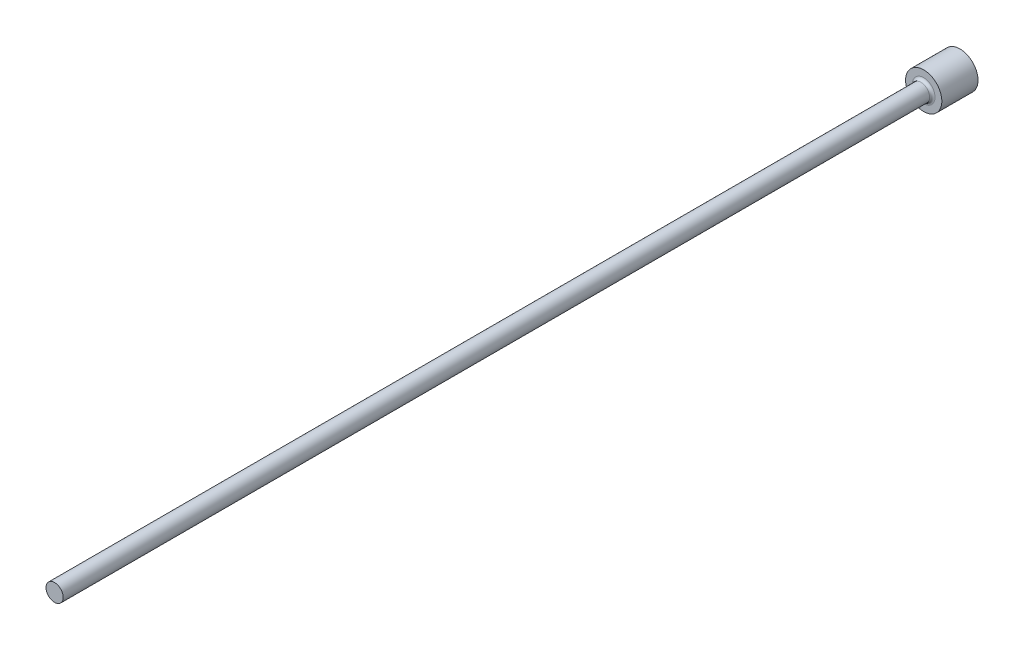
from build123d import *

# Parameters (mm, degrees)
FILLET1_R = 0.3


with BuildPart() as part:
    # FV → Revolve1 (revolve)
    with BuildSketch(Plane(origin=(0, 0, 0), x_dir=(1, 0, 0), z_dir=(0, 1, 0)), mode=Mode.PRIVATE) as revolve1_sk:
        Polygon((0, 0), (2, 0), (2, -4), (0.95, -4), (0.95, -100), (0, -100), align=None)
    revolve(revolve1_sk.sketch.rotate(Axis((0, 0, -9.033228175), (0, 0, 1)), 180), axis=Axis((0, 0, -9.033228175), (0, 0, 1)))

    # Fillet1
    fillet1_edges = [part.edges().sort_by_distance(p)[0] for p in [
        (0.95, 0, 4),
    ]]
    fillet(fillet1_edges, radius=FILLET1_R)


solid = part.part
